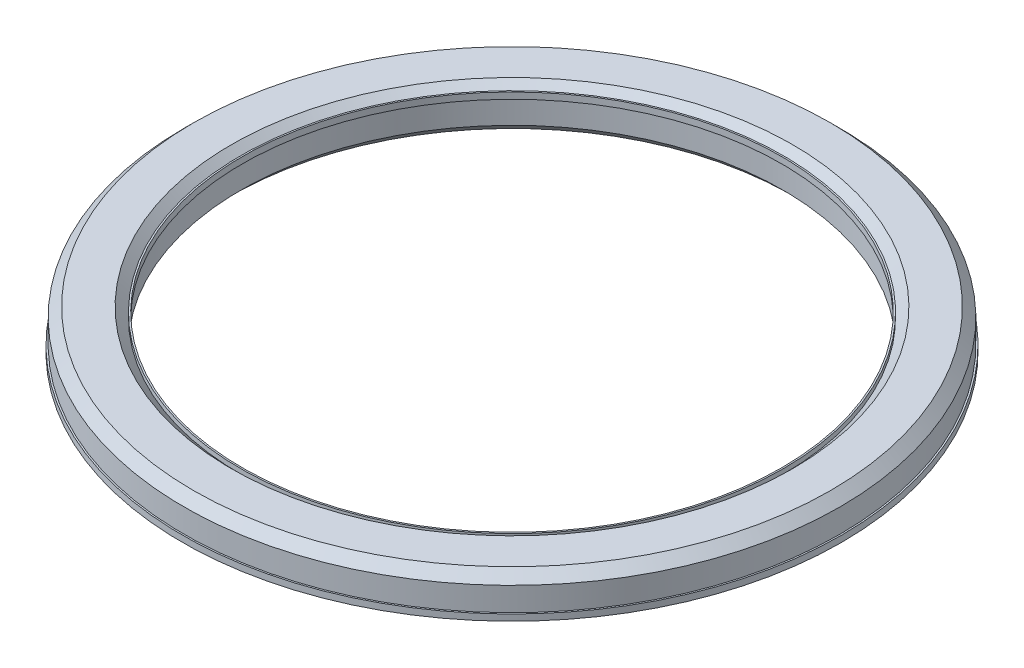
ISO-10303-21;
HEADER;
FILE_DESCRIPTION(('STEP AP214'),'2;1');
FILE_NAME('part.step','',(''),(''),'','','');
FILE_SCHEMA(('AUTOMOTIVE_DESIGN { 1 0 10303 214 1 1 1 1 }'));
ENDSEC;
DATA;
#1=APPLICATION_CONTEXT('core data for automotive mechanical design processes');
#2=APPLICATION_PROTOCOL_DEFINITION('international standard','automotive_design',2000,#1);
#3=PRODUCT_CONTEXT('',#1,'mechanical');
#4=PRODUCT('Part','Part','',(#3));
#5=PRODUCT_RELATED_PRODUCT_CATEGORY('part','',(#4));
#6=PRODUCT_DEFINITION_FORMATION('','',#4);
#7=PRODUCT_DEFINITION_CONTEXT('part definition',#1,'design');
#8=PRODUCT_DEFINITION('design','',#6,#7);
#9=PRODUCT_DEFINITION_SHAPE('','',#8);
#10=(LENGTH_UNIT() NAMED_UNIT(*) SI_UNIT(.MILLI.,.METRE.));
#11=(NAMED_UNIT(*) PLANE_ANGLE_UNIT() SI_UNIT($,.RADIAN.));
#12=(NAMED_UNIT(*) SI_UNIT($,.STERADIAN.) SOLID_ANGLE_UNIT());
#13=UNCERTAINTY_MEASURE_WITH_UNIT(LENGTH_MEASURE(1.E-05),#10,'distance_accuracy_value','');
#14=(GEOMETRIC_REPRESENTATION_CONTEXT(3) GLOBAL_UNCERTAINTY_ASSIGNED_CONTEXT((#13)) GLOBAL_UNIT_ASSIGNED_CONTEXT((#10,
#11,#12)) REPRESENTATION_CONTEXT('',''));
#15=CARTESIAN_POINT('',(0.,0.,0.));
#16=DIRECTION('',(0.,0.,1.));
#17=DIRECTION('',(1.,0.,0.));
#18=AXIS2_PLACEMENT_3D('',#15,#16,#17);
#19=CARTESIAN_POINT('',(0.,-3500.,0.));
#20=DIRECTION('',(0.,-1.,0.));
#21=DIRECTION('',(0.,0.,-1.));
#22=AXIS2_PLACEMENT_3D('',#19,#20,#21);
#23=CONICAL_SURFACE('',#22,86850.,0.785398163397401);
#24=CARTESIAN_POINT('',(0.,-6150.00000000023,0.));
#25=DIRECTION('',(0.,-1.,0.));
#26=DIRECTION('',(0.,0.,-1.));
#27=AXIS2_PLACEMENT_3D('',#24,#25,#26);
#28=CIRCLE('',#27,89500.);
#29=CARTESIAN_POINT('',(89500.,-6150.00000000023,1.60729799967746E-05));
#30=VERTEX_POINT('',#29);
#31=CARTESIAN_POINT('',(89500.,-6150.00000000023,0.));
#32=VERTEX_POINT('',#31);
#33=EDGE_CURVE('E11',#30,#32,#28,.T.);
#34=ORIENTED_EDGE('',*,*,#33,.F.);
#35=DIRECTION('',(0.707106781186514,-0.707106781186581,1.26986739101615E-10));
#36=VECTOR('',#35,1.);
#37=CARTESIAN_POINT('',(89500.,-6150.00000000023,1.60729799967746E-05));
#38=LINE('',#37,#36);
#39=CARTESIAN_POINT('',(86850.,-3500.,1.55970761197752E-05));
#40=VERTEX_POINT('',#39);
#41=EDGE_CURVE('E335',#40,#30,#38,.T.);
#42=ORIENTED_EDGE('',*,*,#41,.F.);
#43=CARTESIAN_POINT('',(0.,-3500.,0.));
#44=DIRECTION('',(0.,-1.,0.));
#45=DIRECTION('',(0.,0.,-1.));
#46=AXIS2_PLACEMENT_3D('',#43,#44,#45);
#47=CIRCLE('',#46,86850.);
#48=CARTESIAN_POINT('',(86850.,-3500.,0.));
#49=VERTEX_POINT('',#48);
#50=EDGE_CURVE('E376',#40,#49,#47,.T.);
#51=ORIENTED_EDGE('',*,*,#50,.T.);
#52=DIRECTION('',(0.707106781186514,-0.707106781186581,0.));
#53=VECTOR('',#52,1.);
#54=CARTESIAN_POINT('',(89500.,-6150.00000000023,0.));
#55=LINE('',#54,#53);
#56=EDGE_CURVE('E288',#49,#32,#55,.T.);
#57=ORIENTED_EDGE('',*,*,#56,.T.);
#58=EDGE_LOOP('',(#34,#42,#51,#57));
#59=FACE_BOUND('',#58,.T.);
#60=ADVANCED_FACE('F39',(#59),#23,.T.);
#61=CARTESIAN_POINT('',(100500.,-6150.00000000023,1.80484300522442E-05));
#62=DIRECTION('',(0.,-1.,0.));
#63=DIRECTION('',(0.,0.,-1.));
#64=AXIS2_PLACEMENT_3D('',#61,#62,#63);
#65=PLANE('',#64);
#66=CARTESIAN_POINT('',(0.,-6150.00000000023,0.));
#67=DIRECTION('',(0.,-1.,0.));
#68=DIRECTION('',(0.,0.,-1.));
#69=AXIS2_PLACEMENT_3D('',#66,#67,#68);
#70=CIRCLE('',#69,100500.);
#71=CARTESIAN_POINT('',(100500.,-6150.00000000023,1.80484300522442E-05));
#72=VERTEX_POINT('',#71);
#73=CARTESIAN_POINT('',(100500.,-6150.00000000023,0.));
#74=VERTEX_POINT('',#73);
#75=EDGE_CURVE('E50',#72,#74,#70,.T.);
#76=ORIENTED_EDGE('',*,*,#75,.F.);
#77=DIRECTION('',(1.,0.,1.79586368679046E-10));
#78=VECTOR('',#77,1.);
#79=CARTESIAN_POINT('',(100500.,-6150.00000000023,1.80484300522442E-05));
#80=LINE('',#79,#78);
#81=EDGE_CURVE('E354',#30,#72,#80,.T.);
#82=ORIENTED_EDGE('',*,*,#81,.F.);
#83=ORIENTED_EDGE('',*,*,#33,.T.);
#84=DIRECTION('',(1.,0.,0.));
#85=VECTOR('',#84,1.);
#86=CARTESIAN_POINT('',(100500.,-6150.00000000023,0.));
#87=LINE('',#86,#85);
#88=EDGE_CURVE('E307',#32,#74,#87,.T.);
#89=ORIENTED_EDGE('',*,*,#88,.T.);
#90=EDGE_LOOP('',(#76,#82,#83,#89));
#91=FACE_BOUND('',#90,.T.);
#92=ADVANCED_FACE('F41',(#91),#65,.F.);
#93=CARTESIAN_POINT('',(0.,-6150.00000000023,0.));
#94=DIRECTION('',(0.,1.,0.));
#95=DIRECTION('',(0.,0.,1.));
#96=AXIS2_PLACEMENT_3D('',#93,#94,#95);
#97=CONICAL_SURFACE('',#96,100500.,0.785398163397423);
#98=CARTESIAN_POINT('',(0.,-3500.,0.));
#99=DIRECTION('',(0.,-1.,0.));
#100=DIRECTION('',(0.,0.,-1.));
#101=AXIS2_PLACEMENT_3D('',#98,#99,#100);
#102=CIRCLE('',#101,103150.);
#103=CARTESIAN_POINT('',(103150.,-3500.,1.85243339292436E-05));
#104=VERTEX_POINT('',#103);
#105=CARTESIAN_POINT('',(103150.,-3500.,0.));
#106=VERTEX_POINT('',#105);
#107=EDGE_CURVE('E387',#104,#106,#102,.T.);
#108=ORIENTED_EDGE('',*,*,#107,.F.);
#109=DIRECTION('',(0.70710678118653,0.707106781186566,1.26986739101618E-10));
#110=VECTOR('',#109,1.);
#111=CARTESIAN_POINT('',(103150.,-3500.,1.85243339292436E-05));
#112=LINE('',#111,#110);
#113=EDGE_CURVE('E348',#72,#104,#112,.T.);
#114=ORIENTED_EDGE('',*,*,#113,.F.);
#115=ORIENTED_EDGE('',*,*,#75,.T.);
#116=DIRECTION('',(0.70710678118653,0.707106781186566,0.));
#117=VECTOR('',#116,1.);
#118=CARTESIAN_POINT('',(103150.,-3500.,0.));
#119=LINE('',#118,#117);
#120=EDGE_CURVE('E302',#74,#106,#119,.T.);
#121=ORIENTED_EDGE('',*,*,#120,.T.);
#122=EDGE_LOOP('',(#108,#114,#115,#121));
#123=FACE_BOUND('',#122,.T.);
#124=ADVANCED_FACE('F388',(#123),#97,.F.);
#125=CARTESIAN_POINT('',(0.,-50000.,0.));
#126=DIRECTION('',(0.,-1.,0.));
#127=DIRECTION('',(0.,0.,-1.));
#128=AXIS2_PLACEMENT_3D('',#125,#126,#127);
#129=CYLINDRICAL_SURFACE('',#128,103150.);
#130=CARTESIAN_POINT('',(0.,3500.,0.));
#131=DIRECTION('',(0.,-1.,0.));
#132=DIRECTION('',(0.,0.,-1.));
#133=AXIS2_PLACEMENT_3D('',#130,#131,#132);
#134=CIRCLE('',#133,103150.);
#135=CARTESIAN_POINT('',(103150.,3500.,1.85243339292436E-05));
#136=VERTEX_POINT('',#135);
#137=CARTESIAN_POINT('',(103150.,3500.,0.));
#138=VERTEX_POINT('',#137);
#139=EDGE_CURVE('E383',#136,#138,#134,.T.);
#140=ORIENTED_EDGE('',*,*,#139,.F.);
#141=DIRECTION('',(0.,1.,0.));
#142=VECTOR('',#141,1.);
#143=CARTESIAN_POINT('',(103150.,3500.,1.85243339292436E-05));
#144=LINE('',#143,#142);
#145=EDGE_CURVE('E350',#104,#136,#144,.T.);
#146=ORIENTED_EDGE('',*,*,#145,.F.);
#147=ORIENTED_EDGE('',*,*,#107,.T.);
#148=DIRECTION('',(0.,1.,0.));
#149=VECTOR('',#148,1.);
#150=CARTESIAN_POINT('',(103150.,3500.,0.));
#151=LINE('',#150,#149);
#152=EDGE_CURVE('E303',#106,#138,#151,.T.);
#153=ORIENTED_EDGE('',*,*,#152,.T.);
#154=EDGE_LOOP('',(#140,#146,#147,#153));
#155=FACE_BOUND('',#154,.T.);
#156=ADVANCED_FACE('F414',(#155),#129,.F.);
#157=CARTESIAN_POINT('',(0.,3500.,0.));
#158=DIRECTION('',(0.,-1.,0.));
#159=DIRECTION('',(0.,0.,-1.));
#160=AXIS2_PLACEMENT_3D('',#157,#158,#159);
#161=CONICAL_SURFACE('',#160,103150.,0.785398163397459);
#162=CARTESIAN_POINT('',(0.,6150.00000000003,0.));
#163=DIRECTION('',(0.,-1.,0.));
#164=DIRECTION('',(0.,0.,-1.));
#165=AXIS2_PLACEMENT_3D('',#162,#163,#164);
#166=CIRCLE('',#165,100500.);
#167=CARTESIAN_POINT('',(100500.,6150.00000000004,1.80484300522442E-05));
#168=VERTEX_POINT('',#167);
#169=CARTESIAN_POINT('',(100500.,6150.00000000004,0.));
#170=VERTEX_POINT('',#169);
#171=EDGE_CURVE('E385',#168,#170,#166,.T.);
#172=ORIENTED_EDGE('',*,*,#171,.F.);
#173=DIRECTION('',(-0.707106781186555,0.70710678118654,-1.26986739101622E-10));
#174=VECTOR('',#173,1.);
#175=CARTESIAN_POINT('',(100500.,6150.00000000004,1.80484300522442E-05));
#176=LINE('',#175,#174);
#177=EDGE_CURVE('E342',#136,#168,#176,.T.);
#178=ORIENTED_EDGE('',*,*,#177,.F.);
#179=ORIENTED_EDGE('',*,*,#139,.T.);
#180=DIRECTION('',(-0.707106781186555,0.70710678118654,0.));
#181=VECTOR('',#180,1.);
#182=CARTESIAN_POINT('',(100500.,6150.00000000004,0.));
#183=LINE('',#182,#181);
#184=EDGE_CURVE('E299',#138,#170,#183,.T.);
#185=ORIENTED_EDGE('',*,*,#184,.T.);
#186=EDGE_LOOP('',(#172,#178,#179,#185));
#187=FACE_BOUND('',#186,.T.);
#188=ADVANCED_FACE('F413',(#187),#161,.F.);
#189=CARTESIAN_POINT('',(89500.,6150.00000000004,1.60729799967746E-05));
#190=DIRECTION('',(0.,1.,0.));
#191=DIRECTION('',(0.,0.,1.));
#192=AXIS2_PLACEMENT_3D('',#189,#190,#191);
#193=PLANE('',#192);
#194=CARTESIAN_POINT('',(0.,6150.00000000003,0.));
#195=DIRECTION('',(0.,-1.,0.));
#196=DIRECTION('',(0.,0.,-1.));
#197=AXIS2_PLACEMENT_3D('',#194,#195,#196);
#198=CIRCLE('',#197,89500.);
#199=CARTESIAN_POINT('',(89500.,6150.00000000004,1.60729799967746E-05));
#200=VERTEX_POINT('',#199);
#201=CARTESIAN_POINT('',(89500.,6150.00000000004,0.));
#202=VERTEX_POINT('',#201);
#203=EDGE_CURVE('E379',#200,#202,#198,.T.);
#204=ORIENTED_EDGE('',*,*,#203,.F.);
#205=DIRECTION('',(-1.,0.,-1.79586368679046E-10));
#206=VECTOR('',#205,1.);
#207=CARTESIAN_POINT('',(89500.,6150.00000000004,1.60729799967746E-05));
#208=LINE('',#207,#206);
#209=EDGE_CURVE('E343',#168,#200,#208,.T.);
#210=ORIENTED_EDGE('',*,*,#209,.F.);
#211=ORIENTED_EDGE('',*,*,#171,.T.);
#212=DIRECTION('',(-1.,0.,0.));
#213=VECTOR('',#212,1.);
#214=CARTESIAN_POINT('',(89500.,6150.00000000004,0.));
#215=LINE('',#214,#213);
#216=EDGE_CURVE('E293',#170,#202,#215,.T.);
#217=ORIENTED_EDGE('',*,*,#216,.T.);
#218=EDGE_LOOP('',(#204,#210,#211,#217));
#219=FACE_BOUND('',#218,.T.);
#220=ADVANCED_FACE('F406',(#219),#193,.F.);
#221=CARTESIAN_POINT('',(0.,6150.00000000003,0.));
#222=DIRECTION('',(0.,1.,0.));
#223=DIRECTION('',(0.,0.,1.));
#224=AXIS2_PLACEMENT_3D('',#221,#222,#223);
#225=CONICAL_SURFACE('',#224,89500.,0.785398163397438);
#226=CARTESIAN_POINT('',(0.,3500.,0.));
#227=DIRECTION('',(0.,-1.,0.));
#228=DIRECTION('',(0.,0.,-1.));
#229=AXIS2_PLACEMENT_3D('',#226,#227,#228);
#230=CIRCLE('',#229,86850.);
#231=CARTESIAN_POINT('',(86850.,3500.,1.55970761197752E-05));
#232=VERTEX_POINT('',#231);
#233=CARTESIAN_POINT('',(86850.,3500.,0.));
#234=VERTEX_POINT('',#233);
#235=EDGE_CURVE('E378',#232,#234,#230,.T.);
#236=ORIENTED_EDGE('',*,*,#235,.F.);
#237=DIRECTION('',(-0.707106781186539,-0.707106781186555,-1.2698673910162E-10));
#238=VECTOR('',#237,1.);
#239=CARTESIAN_POINT('',(86850.,3500.,1.55970761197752E-05));
#240=LINE('',#239,#238);
#241=EDGE_CURVE('E339',#200,#232,#240,.T.);
#242=ORIENTED_EDGE('',*,*,#241,.F.);
#243=ORIENTED_EDGE('',*,*,#203,.T.);
#244=DIRECTION('',(-0.707106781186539,-0.707106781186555,0.));
#245=VECTOR('',#244,1.);
#246=CARTESIAN_POINT('',(86850.,3500.,0.));
#247=LINE('',#246,#245);
#248=EDGE_CURVE('E295',#202,#234,#247,.T.);
#249=ORIENTED_EDGE('',*,*,#248,.T.);
#250=EDGE_LOOP('',(#236,#242,#243,#249));
#251=FACE_BOUND('',#250,.T.);
#252=ADVANCED_FACE('F404',(#251),#225,.T.);
#253=CARTESIAN_POINT('',(0.,-4000.,0.));
#254=DIRECTION('',(0.,-1.,0.));
#255=DIRECTION('',(0.,0.,-1.));
#256=AXIS2_PLACEMENT_3D('',#253,#254,#255);
#257=CONICAL_SURFACE('',#256,86000.,0.785398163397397);
#258=CARTESIAN_POINT('',(0.,-4000.,0.));
#259=DIRECTION('',(0.,-1.,0.));
#260=DIRECTION('',(0.,0.,-1.));
#261=AXIS2_PLACEMENT_3D('',#258,#259,#260);
#262=CIRCLE('',#261,86000.);
#263=CARTESIAN_POINT('',(86000.,-4000.,1.5444427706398E-05));
#264=VERTEX_POINT('',#263);
#265=CARTESIAN_POINT('',(86000.,-4000.,0.));
#266=VERTEX_POINT('',#265);
#267=EDGE_CURVE('E373',#264,#266,#262,.T.);
#268=ORIENTED_EDGE('',*,*,#267,.F.);
#269=DIRECTION('',(0.707106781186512,-0.707106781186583,1.26986739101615E-10));
#270=VECTOR('',#269,1.);
#271=CARTESIAN_POINT('',(89000.,-7000.00000000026,1.59831868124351E-05));
#272=LINE('',#271,#270);
#273=CARTESIAN_POINT('',(89000.,-7000.00000000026,1.59831868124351E-05));
#274=VERTEX_POINT('',#273);
#275=EDGE_CURVE('E309',#264,#274,#272,.T.);
#276=ORIENTED_EDGE('',*,*,#275,.T.);
#277=CARTESIAN_POINT('',(0.,-7000.00000000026,0.));
#278=DIRECTION('',(0.,-1.,0.));
#279=DIRECTION('',(0.,0.,-1.));
#280=AXIS2_PLACEMENT_3D('',#277,#278,#279);
#281=CIRCLE('',#280,89000.);
#282=CARTESIAN_POINT('',(89000.,-7000.00000000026,0.));
#283=VERTEX_POINT('',#282);
#284=EDGE_CURVE('E358',#274,#283,#281,.T.);
#285=ORIENTED_EDGE('',*,*,#284,.T.);
#286=DIRECTION('',(0.707106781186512,-0.707106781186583,0.));
#287=VECTOR('',#286,1.);
#288=CARTESIAN_POINT('',(89000.,-7000.00000000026,0.));
#289=LINE('',#288,#287);
#290=EDGE_CURVE('E242',#266,#283,#289,.T.);
#291=ORIENTED_EDGE('',*,*,#290,.F.);
#292=EDGE_LOOP('',(#268,#276,#285,#291));
#293=FACE_BOUND('',#292,.T.);
#294=ADVANCED_FACE('F445',(#293),#257,.F.);
#295=CARTESIAN_POINT('',(0.,-50000.,0.));
#296=DIRECTION('',(0.,-1.,0.));
#297=DIRECTION('',(0.,0.,-1.));
#298=AXIS2_PLACEMENT_3D('',#295,#296,#297);
#299=CYLINDRICAL_SURFACE('',#298,86000.);
#300=CARTESIAN_POINT('',(0.,3500.,0.));
#301=DIRECTION('',(0.,-1.,0.));
#302=DIRECTION('',(0.,0.,-1.));
#303=AXIS2_PLACEMENT_3D('',#300,#301,#302);
#304=CIRCLE('',#303,86000.);
#305=CARTESIAN_POINT('',(86000.,3500.,1.5444427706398E-05));
#306=VERTEX_POINT('',#305);
#307=CARTESIAN_POINT('',(86000.,3500.,0.));
#308=VERTEX_POINT('',#307);
#309=EDGE_CURVE('E210',#306,#308,#304,.T.);
#310=ORIENTED_EDGE('',*,*,#309,.F.);
#311=DIRECTION('',(0.,-1.,0.));
#312=VECTOR('',#311,1.);
#313=CARTESIAN_POINT('',(86000.,-4000.,1.5444427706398E-05));
#314=LINE('',#313,#312);
#315=EDGE_CURVE('E329',#306,#264,#314,.T.);
#316=ORIENTED_EDGE('',*,*,#315,.T.);
#317=ORIENTED_EDGE('',*,*,#267,.T.);
#318=DIRECTION('',(0.,-1.,0.));
#319=VECTOR('',#318,1.);
#320=CARTESIAN_POINT('',(86000.,-4000.,0.));
#321=LINE('',#320,#319);
#322=EDGE_CURVE('E281',#308,#266,#321,.T.);
#323=ORIENTED_EDGE('',*,*,#322,.F.);
#324=EDGE_LOOP('',(#310,#316,#317,#323));
#325=FACE_BOUND('',#324,.T.);
#326=ADVANCED_FACE('F438',(#325),#299,.F.);
#327=CARTESIAN_POINT('',(0.,7000.00000000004,0.));
#328=DIRECTION('',(0.,1.,0.));
#329=DIRECTION('',(0.,0.,1.));
#330=AXIS2_PLACEMENT_3D('',#327,#328,#329);
#331=CONICAL_SURFACE('',#330,89000.,0.785398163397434);
#332=CARTESIAN_POINT('',(0.,7000.00000000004,0.));
#333=DIRECTION('',(0.,-1.,0.));
#334=DIRECTION('',(0.,0.,-1.));
#335=AXIS2_PLACEMENT_3D('',#332,#333,#334);
#336=CIRCLE('',#335,89000.);
#337=CARTESIAN_POINT('',(89000.,7000.00000000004,1.59831868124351E-05));
#338=VERTEX_POINT('',#337);
#339=CARTESIAN_POINT('',(89000.,7000.00000000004,0.));
#340=VERTEX_POINT('',#339);
#341=EDGE_CURVE('E366',#338,#340,#336,.T.);
#342=ORIENTED_EDGE('',*,*,#341,.F.);
#343=DIRECTION('',(-0.707106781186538,-0.707106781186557,-1.26986739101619E-10));
#344=VECTOR('',#343,1.);
#345=CARTESIAN_POINT('',(86000.,4000.,1.5444427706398E-05));
#346=LINE('',#345,#344);
#347=CARTESIAN_POINT('',(86000.,4000.,1.5444427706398E-05));
#348=VERTEX_POINT('',#347);
#349=EDGE_CURVE('E330',#338,#348,#346,.T.);
#350=ORIENTED_EDGE('',*,*,#349,.T.);
#351=CARTESIAN_POINT('',(0.,4000.,0.));
#352=DIRECTION('',(0.,-1.,0.));
#353=DIRECTION('',(0.,0.,-1.));
#354=AXIS2_PLACEMENT_3D('',#351,#352,#353);
#355=CIRCLE('',#354,86000.);
#356=CARTESIAN_POINT('',(86000.,4000.,0.));
#357=VERTEX_POINT('',#356);
#358=EDGE_CURVE('E367',#348,#357,#355,.T.);
#359=ORIENTED_EDGE('',*,*,#358,.T.);
#360=DIRECTION('',(-0.707106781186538,-0.707106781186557,0.));
#361=VECTOR('',#360,1.);
#362=CARTESIAN_POINT('',(86000.,4000.,0.));
#363=LINE('',#362,#361);
#364=EDGE_CURVE('E282',#340,#357,#363,.T.);
#365=ORIENTED_EDGE('',*,*,#364,.F.);
#366=EDGE_LOOP('',(#342,#350,#359,#365));
#367=FACE_BOUND('',#366,.T.);
#368=ADVANCED_FACE('F442',(#367),#331,.F.);
#369=CARTESIAN_POINT('',(89000.,7000.00000000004,1.59831868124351E-05));
#370=DIRECTION('',(0.,1.,0.));
#371=DIRECTION('',(0.,0.,1.));
#372=AXIS2_PLACEMENT_3D('',#369,#370,#371);
#373=PLANE('',#372);
#374=CARTESIAN_POINT('',(0.,7000.00000000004,0.));
#375=DIRECTION('',(0.,-1.,0.));
#376=DIRECTION('',(0.,0.,-1.));
#377=AXIS2_PLACEMENT_3D('',#374,#375,#376);
#378=CIRCLE('',#377,101000.);
#379=CARTESIAN_POINT('',(101000.,7000.00000000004,1.81382232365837E-05));
#380=VERTEX_POINT('',#379);
#381=CARTESIAN_POINT('',(101000.,7000.00000000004,0.));
#382=VERTEX_POINT('',#381);
#383=EDGE_CURVE('E368',#380,#382,#378,.T.);
#384=ORIENTED_EDGE('',*,*,#383,.F.);
#385=DIRECTION('',(-1.,0.,-1.79586368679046E-10));
#386=VECTOR('',#385,1.);
#387=CARTESIAN_POINT('',(89000.,7000.00000000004,1.59831868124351E-05));
#388=LINE('',#387,#386);
#389=EDGE_CURVE('E322',#380,#338,#388,.T.);
#390=ORIENTED_EDGE('',*,*,#389,.T.);
#391=ORIENTED_EDGE('',*,*,#341,.T.);
#392=DIRECTION('',(-1.,0.,0.));
#393=VECTOR('',#392,1.);
#394=CARTESIAN_POINT('',(89000.,7000.00000000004,0.));
#395=LINE('',#394,#393);
#396=EDGE_CURVE('E279',#382,#340,#395,.T.);
#397=ORIENTED_EDGE('',*,*,#396,.F.);
#398=EDGE_LOOP('',(#384,#390,#391,#397));
#399=FACE_BOUND('',#398,.T.);
#400=ADVANCED_FACE('F447',(#399),#373,.T.);
#401=CARTESIAN_POINT('',(0.,4000.,0.));
#402=DIRECTION('',(0.,-1.,0.));
#403=DIRECTION('',(0.,0.,-1.));
#404=AXIS2_PLACEMENT_3D('',#401,#402,#403);
#405=CONICAL_SURFACE('',#404,104000.,0.78539816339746);
#406=CARTESIAN_POINT('',(0.,4000.,0.));
#407=DIRECTION('',(0.,-1.,0.));
#408=DIRECTION('',(0.,0.,-1.));
#409=AXIS2_PLACEMENT_3D('',#406,#407,#408);
#410=CIRCLE('',#409,104000.);
#411=CARTESIAN_POINT('',(104000.,4000.,1.86769823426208E-05));
#412=VERTEX_POINT('',#411);
#413=CARTESIAN_POINT('',(104000.,4000.,0.));
#414=VERTEX_POINT('',#413);
#415=EDGE_CURVE('E361',#412,#414,#410,.T.);
#416=ORIENTED_EDGE('',*,*,#415,.F.);
#417=DIRECTION('',(-0.707106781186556,0.707106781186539,-1.26986739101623E-10));
#418=VECTOR('',#417,1.);
#419=CARTESIAN_POINT('',(101000.,7000.00000000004,1.81382232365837E-05));
#420=LINE('',#419,#418);
#421=EDGE_CURVE('E321',#412,#380,#420,.T.);
#422=ORIENTED_EDGE('',*,*,#421,.T.);
#423=ORIENTED_EDGE('',*,*,#383,.T.);
#424=DIRECTION('',(-0.707106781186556,0.707106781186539,0.));
#425=VECTOR('',#424,1.);
#426=CARTESIAN_POINT('',(101000.,7000.00000000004,0.));
#427=LINE('',#426,#425);
#428=EDGE_CURVE('E274',#414,#382,#427,.T.);
#429=ORIENTED_EDGE('',*,*,#428,.F.);
#430=EDGE_LOOP('',(#416,#422,#423,#429));
#431=FACE_BOUND('',#430,.T.);
#432=ADVANCED_FACE('F448',(#431),#405,.T.);
#433=CARTESIAN_POINT('',(0.,-50000.,0.));
#434=DIRECTION('',(0.,-1.,0.));
#435=DIRECTION('',(0.,0.,-1.));
#436=AXIS2_PLACEMENT_3D('',#433,#434,#435);
#437=CYLINDRICAL_SURFACE('',#436,104000.);
#438=CARTESIAN_POINT('',(0.,-3500.,0.));
#439=DIRECTION('',(0.,-1.,0.));
#440=DIRECTION('',(0.,0.,-1.));
#441=AXIS2_PLACEMENT_3D('',#438,#439,#440);
#442=CIRCLE('',#441,104000.);
#443=CARTESIAN_POINT('',(104000.,-3500.,1.86769823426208E-05));
#444=VERTEX_POINT('',#443);
#445=CARTESIAN_POINT('',(104000.,-3500.,0.));
#446=VERTEX_POINT('',#445);
#447=EDGE_CURVE('E222',#444,#446,#442,.T.);
#448=ORIENTED_EDGE('',*,*,#447,.F.);
#449=DIRECTION('',(0.,1.,0.));
#450=VECTOR('',#449,1.);
#451=CARTESIAN_POINT('',(104000.,4000.,1.86769823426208E-05));
#452=LINE('',#451,#450);
#453=EDGE_CURVE('E317',#444,#412,#452,.T.);
#454=ORIENTED_EDGE('',*,*,#453,.T.);
#455=ORIENTED_EDGE('',*,*,#415,.T.);
#456=DIRECTION('',(0.,1.,0.));
#457=VECTOR('',#456,1.);
#458=CARTESIAN_POINT('',(104000.,4000.,0.));
#459=LINE('',#458,#457);
#460=EDGE_CURVE('E272',#446,#414,#459,.T.);
#461=ORIENTED_EDGE('',*,*,#460,.F.);
#462=EDGE_LOOP('',(#448,#454,#455,#461));
#463=FACE_BOUND('',#462,.T.);
#464=ADVANCED_FACE('F452',(#463),#437,.T.);
#465=CARTESIAN_POINT('',(0.,-7000.00000000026,0.));
#466=DIRECTION('',(0.,1.,0.));
#467=DIRECTION('',(0.,0.,1.));
#468=AXIS2_PLACEMENT_3D('',#465,#466,#467);
#469=CONICAL_SURFACE('',#468,101000.,0.785398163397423);
#470=CARTESIAN_POINT('',(0.,-7000.00000000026,0.));
#471=DIRECTION('',(0.,-1.,0.));
#472=DIRECTION('',(0.,0.,-1.));
#473=AXIS2_PLACEMENT_3D('',#470,#471,#472);
#474=CIRCLE('',#473,101000.);
#475=CARTESIAN_POINT('',(101000.,-7000.00000000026,1.81382232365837E-05));
#476=VERTEX_POINT('',#475);
#477=CARTESIAN_POINT('',(101000.,-7000.00000000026,0.));
#478=VERTEX_POINT('',#477);
#479=EDGE_CURVE('E356',#476,#478,#474,.T.);
#480=ORIENTED_EDGE('',*,*,#479,.F.);
#481=DIRECTION('',(0.70710678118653,0.707106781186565,1.26986739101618E-10));
#482=VECTOR('',#481,1.);
#483=CARTESIAN_POINT('',(104000.,-4000.,1.86769823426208E-05));
#484=LINE('',#483,#482);
#485=CARTESIAN_POINT('',(104000.,-4000.,1.86769823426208E-05));
#486=VERTEX_POINT('',#485);
#487=EDGE_CURVE('E316',#476,#486,#484,.T.);
#488=ORIENTED_EDGE('',*,*,#487,.T.);
#489=CARTESIAN_POINT('',(0.,-4000.,0.));
#490=DIRECTION('',(0.,-1.,0.));
#491=DIRECTION('',(0.,0.,-1.));
#492=AXIS2_PLACEMENT_3D('',#489,#490,#491);
#493=CIRCLE('',#492,104000.);
#494=CARTESIAN_POINT('',(104000.,-4000.00000000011,0.));
#495=VERTEX_POINT('',#494);
#496=EDGE_CURVE('E359',#486,#495,#493,.T.);
#497=ORIENTED_EDGE('',*,*,#496,.T.);
#498=DIRECTION('',(0.70710678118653,0.707106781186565,0.));
#499=VECTOR('',#498,1.);
#500=CARTESIAN_POINT('',(104000.,-4000.,0.));
#501=LINE('',#500,#499);
#502=EDGE_CURVE('E269',#478,#495,#501,.T.);
#503=ORIENTED_EDGE('',*,*,#502,.F.);
#504=EDGE_LOOP('',(#480,#488,#497,#503));
#505=FACE_BOUND('',#504,.T.);
#506=ADVANCED_FACE('F427',(#505),#469,.T.);
#507=CARTESIAN_POINT('',(101000.,-7000.00000000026,1.81382232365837E-05));
#508=DIRECTION('',(0.,-1.,0.));
#509=DIRECTION('',(0.,0.,-1.));
#510=AXIS2_PLACEMENT_3D('',#507,#508,#509);
#511=PLANE('',#510);
#512=DIRECTION('',(1.,0.,1.79586368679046E-10));
#513=VECTOR('',#512,1.);
#514=CARTESIAN_POINT('',(101000.,-7000.00000000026,1.81382232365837E-05));
#515=LINE('',#514,#513);
#516=EDGE_CURVE('E311',#274,#476,#515,.T.);
#517=ORIENTED_EDGE('',*,*,#516,.T.);
#518=ORIENTED_EDGE('',*,*,#479,.T.);
#519=DIRECTION('',(1.,0.,0.));
#520=VECTOR('',#519,1.);
#521=CARTESIAN_POINT('',(101000.,-7000.00000000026,0.));
#522=LINE('',#521,#520);
#523=EDGE_CURVE('E270',#283,#478,#522,.T.);
#524=ORIENTED_EDGE('',*,*,#523,.F.);
#525=ORIENTED_EDGE('',*,*,#284,.F.);
#526=EDGE_LOOP('',(#517,#518,#524,#525));
#527=FACE_BOUND('',#526,.T.);
#528=ADVANCED_FACE('F419',(#527),#511,.T.);
#529=CARTESIAN_POINT('',(0.,-50000.,0.));
#530=DIRECTION('',(0.,-1.,0.));
#531=DIRECTION('',(0.,0.,-1.));
#532=AXIS2_PLACEMENT_3D('',#529,#530,#531);
#533=CYLINDRICAL_SURFACE('',#532,86850.);
#534=DIRECTION('',(0.,-1.,0.));
#535=VECTOR('',#534,1.);
#536=CARTESIAN_POINT('',(86850.,-3500.,1.55970761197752E-05));
#537=LINE('',#536,#535);
#538=EDGE_CURVE('E333',#232,#40,#537,.T.);
#539=ORIENTED_EDGE('',*,*,#538,.F.);
#540=ORIENTED_EDGE('',*,*,#235,.T.);
#541=DIRECTION('',(0.,-1.,0.));
#542=VECTOR('',#541,1.);
#543=CARTESIAN_POINT('',(86850.,-3500.,0.));
#544=LINE('',#543,#542);
#545=EDGE_CURVE('E287',#234,#49,#544,.T.);
#546=ORIENTED_EDGE('',*,*,#545,.T.);
#547=ORIENTED_EDGE('',*,*,#50,.F.);
#548=EDGE_LOOP('',(#539,#540,#546,#547));
#549=FACE_BOUND('',#548,.T.);
#550=ADVANCED_FACE('F416',(#549),#533,.T.);
#551=CARTESIAN_POINT('',(0.,0.,0.));
#552=DIRECTION('',(1.79586368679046E-10,0.,-1.));
#553=DIRECTION('',(-1.,0.,-1.79586368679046E-10));
#554=AXIS2_PLACEMENT_3D('',#551,#552,#553);
#555=PLANE('',#554);
#556=ORIENTED_EDGE('',*,*,#275,.F.);
#557=ORIENTED_EDGE('',*,*,#315,.F.);
#558=DIRECTION('',(1.,0.,1.79586368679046E-10));
#559=VECTOR('',#558,1.);
#560=CARTESIAN_POINT('',(85500.,3500.,1.53546345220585E-05));
#561=LINE('',#560,#559);
#562=CARTESIAN_POINT('',(85500.,3500.,1.53546345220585E-05));
#563=VERTEX_POINT('',#562);
#564=EDGE_CURVE('E226',#563,#306,#561,.T.);
#565=ORIENTED_EDGE('',*,*,#564,.F.);
#566=DIRECTION('',(0.,-1.,0.));
#567=VECTOR('',#566,1.);
#568=CARTESIAN_POINT('',(85500.,3500.,1.53546345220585E-05));
#569=LINE('',#568,#567);
#570=CARTESIAN_POINT('',(85500.,5500.,1.53546345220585E-05));
#571=VERTEX_POINT('',#570);
#572=EDGE_CURVE('E204',#571,#563,#569,.T.);
#573=ORIENTED_EDGE('',*,*,#572,.F.);
#574=DIRECTION('',(-1.,0.,-1.79586368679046E-10));
#575=VECTOR('',#574,1.);
#576=CARTESIAN_POINT('',(85500.,5500.,1.53546345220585E-05));
#577=LINE('',#576,#575);
#578=CARTESIAN_POINT('',(86000.,5500.,1.5444427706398E-05));
#579=VERTEX_POINT('',#578);
#580=EDGE_CURVE('E208',#579,#571,#577,.T.);
#581=ORIENTED_EDGE('',*,*,#580,.F.);
#582=DIRECTION('',(0.,1.,0.));
#583=VECTOR('',#582,1.);
#584=CARTESIAN_POINT('',(86000.,3500.,1.5444427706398E-05));
#585=LINE('',#584,#583);
#586=EDGE_CURVE('E233',#348,#579,#585,.T.);
#587=ORIENTED_EDGE('',*,*,#586,.F.);
#588=ORIENTED_EDGE('',*,*,#349,.F.);
#589=ORIENTED_EDGE('',*,*,#389,.F.);
#590=ORIENTED_EDGE('',*,*,#421,.F.);
#591=ORIENTED_EDGE('',*,*,#453,.F.);
#592=DIRECTION('',(-1.,0.,-1.79586368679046E-10));
#593=VECTOR('',#592,1.);
#594=CARTESIAN_POINT('',(104000.,-3500.,1.86769823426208E-05));
#595=LINE('',#594,#593);
#596=CARTESIAN_POINT('',(104500.,-3500.,1.87667755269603E-05));
#597=VERTEX_POINT('',#596);
#598=EDGE_CURVE('E256',#597,#444,#595,.T.);
#599=ORIENTED_EDGE('',*,*,#598,.F.);
#600=DIRECTION('',(0.,1.,0.));
#601=VECTOR('',#600,1.);
#602=CARTESIAN_POINT('',(104500.,-5500.,1.87667755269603E-05));
#603=LINE('',#602,#601);
#604=CARTESIAN_POINT('',(104500.,-5500.,1.87667755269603E-05));
#605=VERTEX_POINT('',#604);
#606=EDGE_CURVE('E254',#605,#597,#603,.T.);
#607=ORIENTED_EDGE('',*,*,#606,.F.);
#608=DIRECTION('',(1.,0.,1.79586368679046E-10));
#609=VECTOR('',#608,1.);
#610=CARTESIAN_POINT('',(104000.,-5500.,1.86769823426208E-05));
#611=LINE('',#610,#609);
#612=CARTESIAN_POINT('',(104000.,-5500.,1.86769823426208E-05));
#613=VERTEX_POINT('',#612);
#614=EDGE_CURVE('E252',#613,#605,#611,.T.);
#615=ORIENTED_EDGE('',*,*,#614,.F.);
#616=DIRECTION('',(0.,-1.,0.));
#617=VECTOR('',#616,1.);
#618=CARTESIAN_POINT('',(104000.,-5500.,1.86769823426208E-05));
#619=LINE('',#618,#617);
#620=EDGE_CURVE('E249',#486,#613,#619,.T.);
#621=ORIENTED_EDGE('',*,*,#620,.F.);
#622=ORIENTED_EDGE('',*,*,#487,.F.);
#623=ORIENTED_EDGE('',*,*,#516,.F.);
#624=EDGE_LOOP('',(#556,#557,#565,#573,#581,#587,#588,#589,#590,#591,#599,#607,#615,#621,#622,#623));
#625=FACE_BOUND('',#624,.T.);
#626=ORIENTED_EDGE('',*,*,#41,.T.);
#627=ORIENTED_EDGE('',*,*,#81,.T.);
#628=ORIENTED_EDGE('',*,*,#113,.T.);
#629=ORIENTED_EDGE('',*,*,#145,.T.);
#630=ORIENTED_EDGE('',*,*,#177,.T.);
#631=ORIENTED_EDGE('',*,*,#209,.T.);
#632=ORIENTED_EDGE('',*,*,#241,.T.);
#633=ORIENTED_EDGE('',*,*,#538,.T.);
#634=EDGE_LOOP('',(#626,#627,#628,#629,#630,#631,#632,#633));
#635=FACE_BOUND('',#634,.T.);
#636=ADVANCED_FACE('F417',(#625,#635),#555,.T.);
#637=CARTESIAN_POINT('',(0.,0.,0.));
#638=DIRECTION('',(0.,0.,-1.));
#639=DIRECTION('',(-1.,0.,0.));
#640=AXIS2_PLACEMENT_3D('',#637,#638,#639);
#641=PLANE('',#640);
#642=ORIENTED_EDGE('',*,*,#290,.T.);
#643=ORIENTED_EDGE('',*,*,#523,.T.);
#644=ORIENTED_EDGE('',*,*,#502,.T.);
#645=DIRECTION('',(0.,-1.,0.));
#646=VECTOR('',#645,1.);
#647=CARTESIAN_POINT('',(104000.,-5500.,0.));
#648=LINE('',#647,#646);
#649=CARTESIAN_POINT('',(104000.,-5500.,0.));
#650=VERTEX_POINT('',#649);
#651=EDGE_CURVE('E245',#495,#650,#648,.T.);
#652=ORIENTED_EDGE('',*,*,#651,.T.);
#653=DIRECTION('',(1.,0.,0.));
#654=VECTOR('',#653,1.);
#655=CARTESIAN_POINT('',(104000.,-5500.,0.));
#656=LINE('',#655,#654);
#657=CARTESIAN_POINT('',(104500.,-5500.,0.));
#658=VERTEX_POINT('',#657);
#659=EDGE_CURVE('E241',#650,#658,#656,.T.);
#660=ORIENTED_EDGE('',*,*,#659,.T.);
#661=DIRECTION('',(0.,1.,0.));
#662=VECTOR('',#661,1.);
#663=CARTESIAN_POINT('',(104500.,-5500.,0.));
#664=LINE('',#663,#662);
#665=CARTESIAN_POINT('',(104500.,-3500.,0.));
#666=VERTEX_POINT('',#665);
#667=EDGE_CURVE('E250',#658,#666,#664,.T.);
#668=ORIENTED_EDGE('',*,*,#667,.T.);
#669=DIRECTION('',(-1.,0.,0.));
#670=VECTOR('',#669,1.);
#671=CARTESIAN_POINT('',(104000.,-3500.,0.));
#672=LINE('',#671,#670);
#673=EDGE_CURVE('E62',#666,#446,#672,.T.);
#674=ORIENTED_EDGE('',*,*,#673,.T.);
#675=ORIENTED_EDGE('',*,*,#460,.T.);
#676=ORIENTED_EDGE('',*,*,#428,.T.);
#677=ORIENTED_EDGE('',*,*,#396,.T.);
#678=ORIENTED_EDGE('',*,*,#364,.T.);
#679=DIRECTION('',(0.,1.,0.));
#680=VECTOR('',#679,1.);
#681=CARTESIAN_POINT('',(86000.,3500.,0.));
#682=LINE('',#681,#680);
#683=CARTESIAN_POINT('',(86000.,5500.,0.));
#684=VERTEX_POINT('',#683);
#685=EDGE_CURVE('E213',#357,#684,#682,.T.);
#686=ORIENTED_EDGE('',*,*,#685,.T.);
#687=DIRECTION('',(-1.,0.,0.));
#688=VECTOR('',#687,1.);
#689=CARTESIAN_POINT('',(85500.,5500.,0.));
#690=LINE('',#689,#688);
#691=CARTESIAN_POINT('',(85500.,5500.,0.));
#692=VERTEX_POINT('',#691);
#693=EDGE_CURVE('E219',#684,#692,#690,.T.);
#694=ORIENTED_EDGE('',*,*,#693,.T.);
#695=DIRECTION('',(0.,-1.,0.));
#696=VECTOR('',#695,1.);
#697=CARTESIAN_POINT('',(85500.,3500.,0.));
#698=LINE('',#697,#696);
#699=CARTESIAN_POINT('',(85500.,3500.,0.));
#700=VERTEX_POINT('',#699);
#701=EDGE_CURVE('E205',#692,#700,#698,.T.);
#702=ORIENTED_EDGE('',*,*,#701,.T.);
#703=DIRECTION('',(1.,0.,0.));
#704=VECTOR('',#703,1.);
#705=CARTESIAN_POINT('',(85500.,3500.,0.));
#706=LINE('',#705,#704);
#707=EDGE_CURVE('E53',#700,#308,#706,.T.);
#708=ORIENTED_EDGE('',*,*,#707,.T.);
#709=ORIENTED_EDGE('',*,*,#322,.T.);
#710=EDGE_LOOP('',(#642,#643,#644,#652,#660,#668,#674,#675,#676,#677,#678,#686,#694,#702,#708,#709));
#711=FACE_BOUND('',#710,.T.);
#712=ORIENTED_EDGE('',*,*,#56,.F.);
#713=ORIENTED_EDGE('',*,*,#545,.F.);
#714=ORIENTED_EDGE('',*,*,#248,.F.);
#715=ORIENTED_EDGE('',*,*,#216,.F.);
#716=ORIENTED_EDGE('',*,*,#184,.F.);
#717=ORIENTED_EDGE('',*,*,#152,.F.);
#718=ORIENTED_EDGE('',*,*,#120,.F.);
#719=ORIENTED_EDGE('',*,*,#88,.F.);
#720=EDGE_LOOP('',(#712,#713,#714,#715,#716,#717,#718,#719));
#721=FACE_BOUND('',#720,.T.);
#722=ADVANCED_FACE('F220',(#711,#721),#641,.F.);
#723=CARTESIAN_POINT('',(0.,-50000.,0.));
#724=DIRECTION('',(0.,-1.,0.));
#725=DIRECTION('',(0.,0.,-1.));
#726=AXIS2_PLACEMENT_3D('',#723,#724,#725);
#727=CYLINDRICAL_SURFACE('',#726,104000.);
#728=ORIENTED_EDGE('',*,*,#651,.F.);
#729=ORIENTED_EDGE('',*,*,#496,.F.);
#730=ORIENTED_EDGE('',*,*,#620,.T.);
#731=CARTESIAN_POINT('',(0.,-5500.,0.));
#732=DIRECTION('',(0.,-1.,0.));
#733=DIRECTION('',(0.,0.,-1.));
#734=AXIS2_PLACEMENT_3D('',#731,#732,#733);
#735=CIRCLE('',#734,104000.);
#736=EDGE_CURVE('E257',#613,#650,#735,.T.);
#737=ORIENTED_EDGE('',*,*,#736,.T.);
#738=EDGE_LOOP('',(#728,#729,#730,#737));
#739=FACE_BOUND('',#738,.T.);
#740=ADVANCED_FACE('F470',(#739),#727,.F.);
#741=CARTESIAN_POINT('',(104000.,-3500.,1.86769823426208E-05));
#742=DIRECTION('',(0.,1.,0.));
#743=DIRECTION('',(0.,0.,1.));
#744=AXIS2_PLACEMENT_3D('',#741,#742,#743);
#745=PLANE('',#744);
#746=CARTESIAN_POINT('',(0.,-3500.,0.));
#747=DIRECTION('',(0.,-1.,0.));
#748=DIRECTION('',(0.,0.,-1.));
#749=AXIS2_PLACEMENT_3D('',#746,#747,#748);
#750=CIRCLE('',#749,104500.);
#751=EDGE_CURVE('E224',#597,#666,#750,.T.);
#752=ORIENTED_EDGE('',*,*,#751,.F.);
#753=ORIENTED_EDGE('',*,*,#598,.T.);
#754=ORIENTED_EDGE('',*,*,#447,.T.);
#755=ORIENTED_EDGE('',*,*,#673,.F.);
#756=EDGE_LOOP('',(#752,#753,#754,#755));
#757=FACE_BOUND('',#756,.T.);
#758=ADVANCED_FACE('F466',(#757),#745,.T.);
#759=CARTESIAN_POINT('',(0.,-50000.,0.));
#760=DIRECTION('',(0.,-1.,0.));
#761=DIRECTION('',(0.,0.,-1.));
#762=AXIS2_PLACEMENT_3D('',#759,#760,#761);
#763=CYLINDRICAL_SURFACE('',#762,104500.);
#764=CARTESIAN_POINT('',(0.,-5500.,0.));
#765=DIRECTION('',(0.,-1.,0.));
#766=DIRECTION('',(0.,0.,-1.));
#767=AXIS2_PLACEMENT_3D('',#764,#765,#766);
#768=CIRCLE('',#767,104500.);
#769=EDGE_CURVE('E263',#605,#658,#768,.T.);
#770=ORIENTED_EDGE('',*,*,#769,.F.);
#771=ORIENTED_EDGE('',*,*,#606,.T.);
#772=ORIENTED_EDGE('',*,*,#751,.T.);
#773=ORIENTED_EDGE('',*,*,#667,.F.);
#774=EDGE_LOOP('',(#770,#771,#772,#773));
#775=FACE_BOUND('',#774,.T.);
#776=ADVANCED_FACE('F473',(#775),#763,.T.);
#777=CARTESIAN_POINT('',(104000.,-5500.,1.86769823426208E-05));
#778=DIRECTION('',(0.,-1.,0.));
#779=DIRECTION('',(0.,0.,-1.));
#780=AXIS2_PLACEMENT_3D('',#777,#778,#779);
#781=PLANE('',#780);
#782=ORIENTED_EDGE('',*,*,#614,.T.);
#783=ORIENTED_EDGE('',*,*,#769,.T.);
#784=ORIENTED_EDGE('',*,*,#659,.F.);
#785=ORIENTED_EDGE('',*,*,#736,.F.);
#786=EDGE_LOOP('',(#782,#783,#784,#785));
#787=FACE_BOUND('',#786,.T.);
#788=ADVANCED_FACE('F474',(#787),#781,.T.);
#789=CARTESIAN_POINT('',(0.,-50000.,0.));
#790=DIRECTION('',(0.,-1.,0.));
#791=DIRECTION('',(0.,0.,-1.));
#792=AXIS2_PLACEMENT_3D('',#789,#790,#791);
#793=CYLINDRICAL_SURFACE('',#792,85500.);
#794=CARTESIAN_POINT('',(0.,5500.,0.));
#795=DIRECTION('',(0.,-1.,0.));
#796=DIRECTION('',(0.,0.,-1.));
#797=AXIS2_PLACEMENT_3D('',#794,#795,#796);
#798=CIRCLE('',#797,85500.);
#799=EDGE_CURVE('E239',#571,#692,#798,.T.);
#800=ORIENTED_EDGE('',*,*,#799,.F.);
#801=ORIENTED_EDGE('',*,*,#572,.T.);
#802=CARTESIAN_POINT('',(0.,3500.,0.));
#803=DIRECTION('',(0.,-1.,0.));
#804=DIRECTION('',(0.,0.,-1.));
#805=AXIS2_PLACEMENT_3D('',#802,#803,#804);
#806=CIRCLE('',#805,85500.);
#807=EDGE_CURVE('E199',#563,#700,#806,.T.);
#808=ORIENTED_EDGE('',*,*,#807,.T.);
#809=ORIENTED_EDGE('',*,*,#701,.F.);
#810=EDGE_LOOP('',(#800,#801,#808,#809));
#811=FACE_BOUND('',#810,.T.);
#812=ADVANCED_FACE('F203',(#811),#793,.F.);
#813=CARTESIAN_POINT('',(85500.,5500.,1.53546345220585E-05));
#814=DIRECTION('',(0.,1.,0.));
#815=DIRECTION('',(0.,0.,1.));
#816=AXIS2_PLACEMENT_3D('',#813,#814,#815);
#817=PLANE('',#816);
#818=CARTESIAN_POINT('',(0.,5500.,0.));
#819=DIRECTION('',(0.,-1.,0.));
#820=DIRECTION('',(0.,0.,-1.));
#821=AXIS2_PLACEMENT_3D('',#818,#819,#820);
#822=CIRCLE('',#821,86000.);
#823=EDGE_CURVE('E237',#579,#684,#822,.T.);
#824=ORIENTED_EDGE('',*,*,#823,.F.);
#825=ORIENTED_EDGE('',*,*,#580,.T.);
#826=ORIENTED_EDGE('',*,*,#799,.T.);
#827=ORIENTED_EDGE('',*,*,#693,.F.);
#828=EDGE_LOOP('',(#824,#825,#826,#827));
#829=FACE_BOUND('',#828,.T.);
#830=ADVANCED_FACE('F483',(#829),#817,.T.);
#831=CARTESIAN_POINT('',(0.,-50000.,0.));
#832=DIRECTION('',(0.,-1.,0.));
#833=DIRECTION('',(0.,0.,-1.));
#834=AXIS2_PLACEMENT_3D('',#831,#832,#833);
#835=CYLINDRICAL_SURFACE('',#834,86000.);
#836=ORIENTED_EDGE('',*,*,#685,.F.);
#837=ORIENTED_EDGE('',*,*,#358,.F.);
#838=ORIENTED_EDGE('',*,*,#586,.T.);
#839=ORIENTED_EDGE('',*,*,#823,.T.);
#840=EDGE_LOOP('',(#836,#837,#838,#839));
#841=FACE_BOUND('',#840,.T.);
#842=ADVANCED_FACE('F486',(#841),#835,.T.);
#843=CARTESIAN_POINT('',(85500.,3500.,1.53546345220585E-05));
#844=DIRECTION('',(0.,-1.,0.));
#845=DIRECTION('',(0.,0.,-1.));
#846=AXIS2_PLACEMENT_3D('',#843,#844,#845);
#847=PLANE('',#846);
#848=ORIENTED_EDGE('',*,*,#564,.T.);
#849=ORIENTED_EDGE('',*,*,#309,.T.);
#850=ORIENTED_EDGE('',*,*,#707,.F.);
#851=ORIENTED_EDGE('',*,*,#807,.F.);
#852=EDGE_LOOP('',(#848,#849,#850,#851));
#853=FACE_BOUND('',#852,.T.);
#854=ADVANCED_FACE('F209',(#853),#847,.T.);
#855=CLOSED_SHELL('',(#60,#92,#124,#156,#188,#220,#252,#294,#326,#368,#400,#432,#464,#506,#528,
#550,#636,#722,#740,#758,#776,#788,#812,#830,#842,#854));
#856=MANIFOLD_SOLID_BREP('B2',#855);
#857=ADVANCED_BREP_SHAPE_REPRESENTATION('',(#18,#856),#14);
#858=SHAPE_DEFINITION_REPRESENTATION(#9,#857);
ENDSEC;
END-ISO-10303-21;
